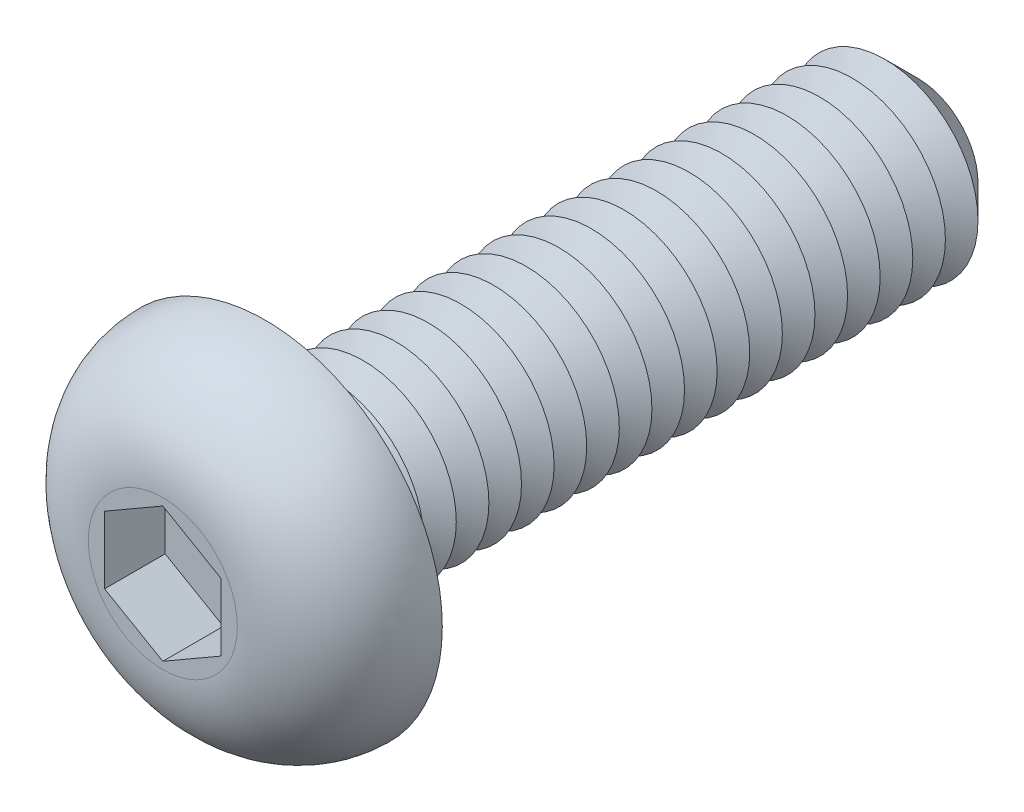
from build123d import *

# Parameters (mm, degrees)
CUT_EXTRUDE1_DEPTH  = 1.3
SKETCH4_R           = 2
BOSS_EXTRUDE1_DEPTH = 14
CHAMFER1_SIZE       = 0.7
LPATTERN1_COUNT     = 18
LPATTERN1_PITCH     = 0.7
FILLET2_R           = 0.35
SKETCH6_R           = 0.5
CUT_EXTRUDE2_DEPTH  = 14.9


with BuildPart() as part:
    # Sketch2 → Revolve1 (revolve)
    with BuildSketch(Plane(origin=(0, 0, 0), x_dir=(0, 0, -1), z_dir=(1, 0, 0)), mode=Mode.PRIVATE) as revolve1_sk:
        with BuildLine():
            Line((0, 0), (-2.2, 0))
            Line((-2.2, 0), (-2.2, 1.6))
            ThreePointArc((-2.2, 1.6), (-1.555634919, 3.155634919), (0, 3.8))
            Line((0, 3.8), (0, 0))
        make_face()
    revolve(revolve1_sk.sketch.rotate(Axis((0, 0, 47.934239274), (0, 0, -1)), 90), axis=Axis((0, 0, 47.934239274), (0, 0, -1)))

    # Sketch3 → Cut-Extrude1 (cut)
    with BuildSketch(Plane.XY.offset(2.2)):
        Polygon((0, 1.443375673), (-1.25, 0.721687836), (-1.25, -0.721687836), (0, -1.443375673), (1.25, -0.721687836), (1.25, 0.721687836), align=None)
    extrude(amount=-CUT_EXTRUDE1_DEPTH, mode=Mode.SUBTRACT)

    # Sketch4 → Boss-Extrude1 (add)
    with BuildSketch(Plane(origin=(0, 0, 0), x_dir=(-1, 0, 0), z_dir=(0, 0, -1))):
        with Locations(Location((0, 0, 0), (0, 0, 180))):
            Circle(SKETCH4_R)
    extrude(amount=BOSS_EXTRUDE1_DEPTH)

    # Chamfer1
    chamfer1_edges = [part.edges().sort_by_distance(p)[0] for p in [
        (-2, 0, -14),
    ]]
    chamfer(chamfer1_edges, length=CHAMFER1_SIZE)

    # Sketch5 → Cut-Revolve1 (revolve, cut)
    with BuildSketch(Plane(origin=(0, 0, 0), x_dir=(0, 0, -1), z_dir=(1, 0, 0)), mode=Mode.PRIVATE) as cut_revolve1_sk:
        Polygon((0.7, 2), (1.4, 2), (1.05, 1.393782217), align=None)
    cut_revolve1 = revolve(cut_revolve1_sk.sketch.rotate(Axis((0, 0, 47.934239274), (0, 0, -1)), 90), axis=Axis((0, 0, 47.934239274), (0, 0, -1)), mode=Mode.SUBTRACT)

    # LPattern1: Cut-Revolve1 ×18
    with Locations(*[(0, 0, -i * LPATTERN1_PITCH) for i in range(1, LPATTERN1_COUNT)]):
        add(cut_revolve1, mode=Mode.SUBTRACT)

    # Fillet2
    fillet2_edges = [part.edges().sort_by_distance(p)[0] for p in [
        (-2, 0, 0),
    ]]
    fillet(fillet2_edges, radius=FILLET2_R)

    # Sketch6 → Cut-Extrude2 (cut)
    with BuildSketch(Plane.XY.offset(0.9)):
        Circle(SKETCH6_R)
    extrude(amount=-CUT_EXTRUDE2_DEPTH, mode=Mode.SUBTRACT)


solid = part.part
